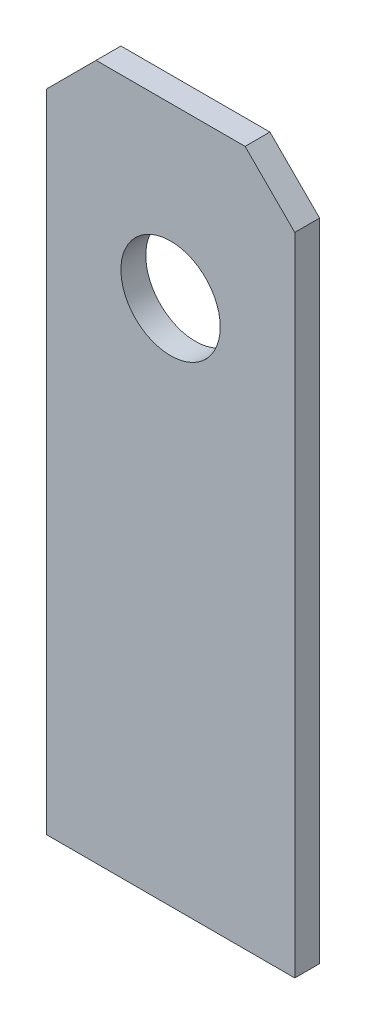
from build123d import *

# Parameters (mm, degrees)
ESQUISSE1_W      = 50
ESQUISSE1_H      = 140
ESQUISSE1_R      = 10
EXTRUSION1_DEPTH = 5
CHANFREIN1_SIZE  = 10


with BuildPart() as part:
    # Esquisse1 → Extrusion1 (new body)
    with BuildSketch(Plane.XY):
        with Locations((25, 70)):
            Rectangle(ESQUISSE1_W, ESQUISSE1_H)
        with Locations((25, 106)):
            Circle(ESQUISSE1_R, mode=Mode.SUBTRACT)
    extrude(amount=EXTRUSION1_DEPTH)

    # Chanfrein1
    chanfrein1_edges = [part.edges().sort_by_distance(p)[0] for p in [
        (0, 140, 2.5),
        (50, 140, 2.5),
    ]]
    chamfer(chanfrein1_edges, length=CHANFREIN1_SIZE)


solid = part.part
